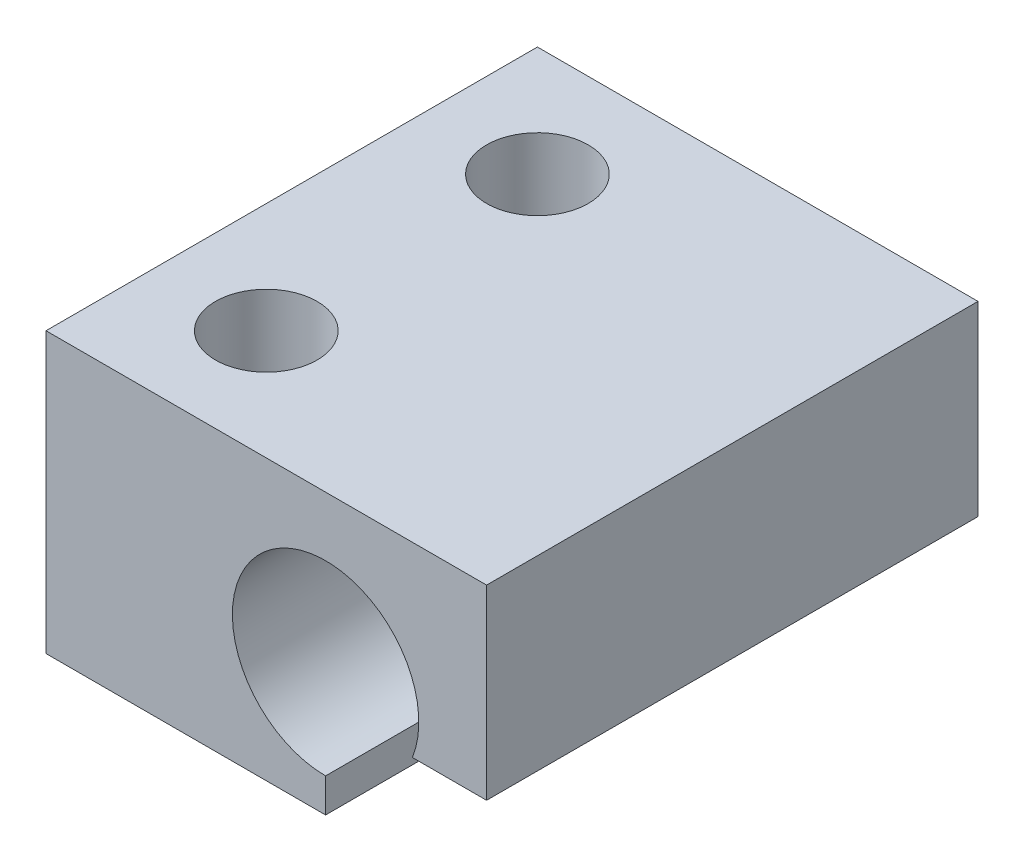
from build123d import *

# Parameters (mm, degrees)
EXTRUIR1_DEPTH       = 29
TALADRO1_D           = 6
TALADRO1_DEPTH       = 16.5
TALADRO1_CBORE_D     = 9.5
TALADRO1_CBORE_DEPTH = 3.5
TALADRO1_TIP         = 7.242640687


with BuildPart() as part:
    # Croquis1 → Extruir1 (new body)
    with BuildSketch(Plane.XY):
        with BuildLine():
            Line((3.5, -6.25), (3.5, -8.25))
            Line((3.5, -8.25), (-13, -8.25))
            Line((-13, -8.25), (-13, 8.25))
            Line((-13, 8.25), (13, 8.25))
            Line((13, 8.25), (13, -2.75))
            Line((13, -2.75), (8.623475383, -2.75))
            ThreePointArc((8.623475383, -2.75), (0.397581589, 3.791475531), (3.5, -6.25))
        make_face()
    extrude(amount=EXTRUIR1_DEPTH)

    # Taladro1
    with Locations(Plane(origin=(-6.5, -8.25, 22.5), x_dir=(0, 0, -1), z_dir=(0, -1, 0))):
        with Locations((0, 0), (16, 0)):
            CounterBoreHole(TALADRO1_D / 2, TALADRO1_CBORE_D / 2, TALADRO1_CBORE_DEPTH, depth=TALADRO1_DEPTH)
            with Locations((0, 0, -(TALADRO1_DEPTH + TALADRO1_TIP / 2))):  # 45° drill point
                Cone(0, TALADRO1_D / 2, TALADRO1_TIP, mode=Mode.SUBTRACT)


solid = part.part
